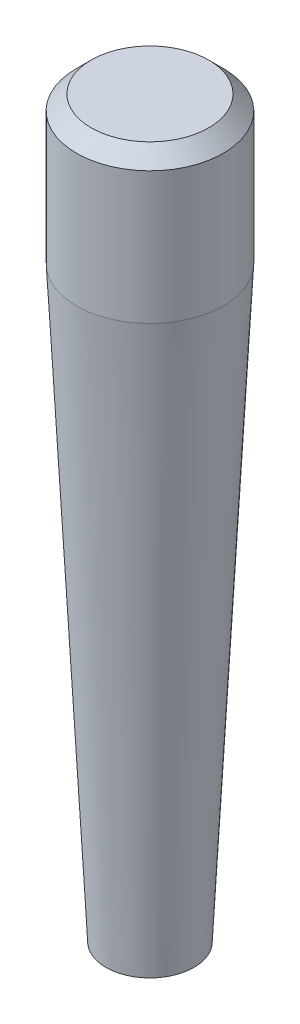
ISO-10303-21;
HEADER;
FILE_DESCRIPTION(('STEP AP214'),'2;1');
FILE_NAME('part.step','',(''),(''),'','','');
FILE_SCHEMA(('AUTOMOTIVE_DESIGN { 1 0 10303 214 1 1 1 1 }'));
ENDSEC;
DATA;
#1=APPLICATION_CONTEXT('core data for automotive mechanical design processes');
#2=APPLICATION_PROTOCOL_DEFINITION('international standard','automotive_design',2000,#1);
#3=PRODUCT_CONTEXT('',#1,'mechanical');
#4=PRODUCT('Part','Part','',(#3));
#5=PRODUCT_RELATED_PRODUCT_CATEGORY('part','',(#4));
#6=PRODUCT_DEFINITION_FORMATION('','',#4);
#7=PRODUCT_DEFINITION_CONTEXT('part definition',#1,'design');
#8=PRODUCT_DEFINITION('design','',#6,#7);
#9=PRODUCT_DEFINITION_SHAPE('','',#8);
#10=(LENGTH_UNIT() NAMED_UNIT(*) SI_UNIT(.MILLI.,.METRE.));
#11=(NAMED_UNIT(*) PLANE_ANGLE_UNIT() SI_UNIT($,.RADIAN.));
#12=(NAMED_UNIT(*) SI_UNIT($,.STERADIAN.) SOLID_ANGLE_UNIT());
#13=UNCERTAINTY_MEASURE_WITH_UNIT(LENGTH_MEASURE(1.E-05),#10,'distance_accuracy_value','');
#14=(GEOMETRIC_REPRESENTATION_CONTEXT(3) GLOBAL_UNCERTAINTY_ASSIGNED_CONTEXT((#13)) GLOBAL_UNIT_ASSIGNED_CONTEXT((#10,
#11,#12)) REPRESENTATION_CONTEXT('',''));
#15=CARTESIAN_POINT('',(0.,0.,0.));
#16=DIRECTION('',(0.,0.,1.));
#17=DIRECTION('',(1.,0.,0.));
#18=AXIS2_PLACEMENT_3D('',#15,#16,#17);
#19=CARTESIAN_POINT('',(-5.,0.,0.));
#20=DIRECTION('',(0.,1.,0.));
#21=DIRECTION('',(-1.,0.,0.));
#22=AXIS2_PLACEMENT_3D('',#19,#20,#21);
#23=PLANE('',#22);
#24=CARTESIAN_POINT('',(0.,0.,0.));
#25=DIRECTION('',(0.,1.,0.));
#26=DIRECTION('',(-1.,0.,0.));
#27=AXIS2_PLACEMENT_3D('',#24,#25,#26);
#28=CIRCLE('',#27,4.);
#29=CARTESIAN_POINT('',(-4.,0.,0.));
#30=VERTEX_POINT('',#29);
#31=EDGE_CURVE('E40',#30,#30,#28,.T.);
#32=ORIENTED_EDGE('',*,*,#31,.T.);
#33=EDGE_LOOP('',(#32));
#34=FACE_BOUND('',#33,.T.);
#35=ADVANCED_FACE('F33',(#34),#23,.T.);
#36=CARTESIAN_POINT('',(0.,-50.,0.));
#37=DIRECTION('',(0.,-1.,0.));
#38=DIRECTION('',(1.,0.,0.));
#39=AXIS2_PLACEMENT_3D('',#36,#37,#38);
#40=PLANE('',#39);
#41=CARTESIAN_POINT('',(0.,-50.,0.));
#42=DIRECTION('',(0.,1.,0.));
#43=DIRECTION('',(-1.,0.,0.));
#44=AXIS2_PLACEMENT_3D('',#41,#42,#43);
#45=CIRCLE('',#44,3.);
#46=CARTESIAN_POINT('',(-2.99999999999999,-50.,0.));
#47=VERTEX_POINT('',#46);
#48=EDGE_CURVE('E44',#47,#47,#45,.T.);
#49=ORIENTED_EDGE('',*,*,#48,.F.);
#50=EDGE_LOOP('',(#49));
#51=FACE_BOUND('',#50,.T.);
#52=ADVANCED_FACE('F58',(#51),#40,.T.);
#53=CARTESIAN_POINT('',(0.,-10.,0.));
#54=DIRECTION('',(0.,1.,0.));
#55=DIRECTION('',(-1.,0.,0.));
#56=AXIS2_PLACEMENT_3D('',#53,#54,#55);
#57=CONICAL_SURFACE('',#56,5.,0.0499583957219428);
#58=ORIENTED_EDGE('',*,*,#48,.T.);
#59=EDGE_LOOP('',(#58));
#60=FACE_BOUND('',#59,.T.);
#61=CARTESIAN_POINT('',(0.,-10.,0.));
#62=DIRECTION('',(0.,1.,0.));
#63=DIRECTION('',(-1.,0.,0.));
#64=AXIS2_PLACEMENT_3D('',#61,#62,#63);
#65=CIRCLE('',#64,5.);
#66=CARTESIAN_POINT('',(-5.,-10.,0.));
#67=VERTEX_POINT('',#66);
#68=EDGE_CURVE('E48',#67,#67,#65,.T.);
#69=ORIENTED_EDGE('',*,*,#68,.F.);
#70=EDGE_LOOP('',(#69));
#71=FACE_BOUND('',#70,.T.);
#72=ADVANCED_FACE('F56',(#60,#71),#57,.T.);
#73=CARTESIAN_POINT('',(0.,0.,0.));
#74=DIRECTION('',(0.,1.,0.));
#75=DIRECTION('',(-1.,0.,0.));
#76=AXIS2_PLACEMENT_3D('',#73,#74,#75);
#77=CYLINDRICAL_SURFACE('',#76,5.);
#78=CARTESIAN_POINT('',(0.,-1.00000000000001,0.));
#79=DIRECTION('',(0.,1.,0.));
#80=DIRECTION('',(-1.,0.,0.));
#81=AXIS2_PLACEMENT_3D('',#78,#79,#80);
#82=CIRCLE('',#81,5.);
#83=CARTESIAN_POINT('',(-5.,-1.00000000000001,0.));
#84=VERTEX_POINT('',#83);
#85=EDGE_CURVE('E10',#84,#84,#82,.F.);
#86=ORIENTED_EDGE('',*,*,#85,.T.);
#87=EDGE_LOOP('',(#86));
#88=FACE_BOUND('',#87,.T.);
#89=ORIENTED_EDGE('',*,*,#68,.T.);
#90=EDGE_LOOP('',(#89));
#91=FACE_BOUND('',#90,.T.);
#92=ADVANCED_FACE('F54',(#88,#91),#77,.T.);
#93=CARTESIAN_POINT('',(0.,0.,0.));
#94=DIRECTION('',(0.,-1.,0.));
#95=DIRECTION('',(1.,0.,0.));
#96=AXIS2_PLACEMENT_3D('',#93,#94,#95);
#97=CONICAL_SURFACE('',#96,4.,0.785398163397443);
#98=ORIENTED_EDGE('',*,*,#85,.F.);
#99=EDGE_LOOP('',(#98));
#100=FACE_BOUND('',#99,.T.);
#101=ORIENTED_EDGE('',*,*,#31,.F.);
#102=EDGE_LOOP('',(#101));
#103=FACE_BOUND('',#102,.T.);
#104=ADVANCED_FACE('F35',(#100,#103),#97,.T.);
#105=CLOSED_SHELL('',(#35,#52,#72,#92,#104));
#106=MANIFOLD_SOLID_BREP('B2',#105);
#107=ADVANCED_BREP_SHAPE_REPRESENTATION('',(#18,#106),#14);
#108=SHAPE_DEFINITION_REPRESENTATION(#9,#107);
ENDSEC;
END-ISO-10303-21;
